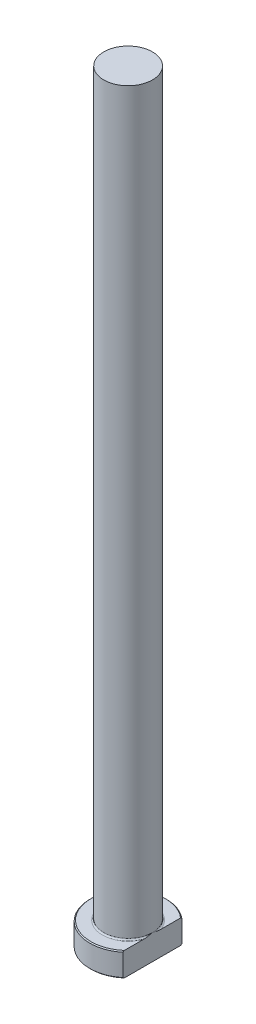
from build123d import *
from build123d.topology import SkipClean

# Parameters (mm, degrees)
CHAMFER1_SIZE = 0.2
FILLET1_R     = 0.3
KEY_DEPTH     = 161.399501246


with BuildPart() as part:
    # Sketch1 → Revolve1 (revolve)
    with BuildSketch(Plane.XY, mode=Mode.PRIVATE) as revolve1_sk:
        Polygon((0, 0), (-8, 0), (-8, 5), (-5.1, 5), (-5.1, 160), (0, 160), align=None)
    revolve(revolve1_sk.sketch.rotate(Axis((0, 259.958771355, 0), (0, -1, 0)), 270), axis=Axis((0, 259.958771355, 0), (0, -1, 0)))

    # Chamfer1
    chamfer1_edges = [part.edges().sort_by_distance(p)[0] for p in [
        (0, 5, -8),
        (0, 0, -8),
    ]]
    chamfer(chamfer1_edges, length=CHAMFER1_SIZE)

    # Fillet1
    fillet1_edges = [part.edges().sort_by_distance(p)[0] for p in [
        (0, 5, -5.1),
    ]]
    fillet(fillet1_edges, radius=FILLET1_R)

    # Sketch2 → KEY (cut, through all)
    with SkipClean():  # the faces are left unmerged after this step: merging them gives an invalid solid
        with BuildSketch(Plane(origin=(0, 0, 0), x_dir=(1, 0, 0), z_dir=(0, 1, 0))):
            with BuildLine():
                Line((5.1, 6.163602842), (5.1, -6.163602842))
                ThreePointArc((5.1, -6.163602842), (8, 0), (5.1, 6.163602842))
            make_face()
        extrude(amount=KEY_DEPTH, mode=Mode.SUBTRACT)


solid = part.part
